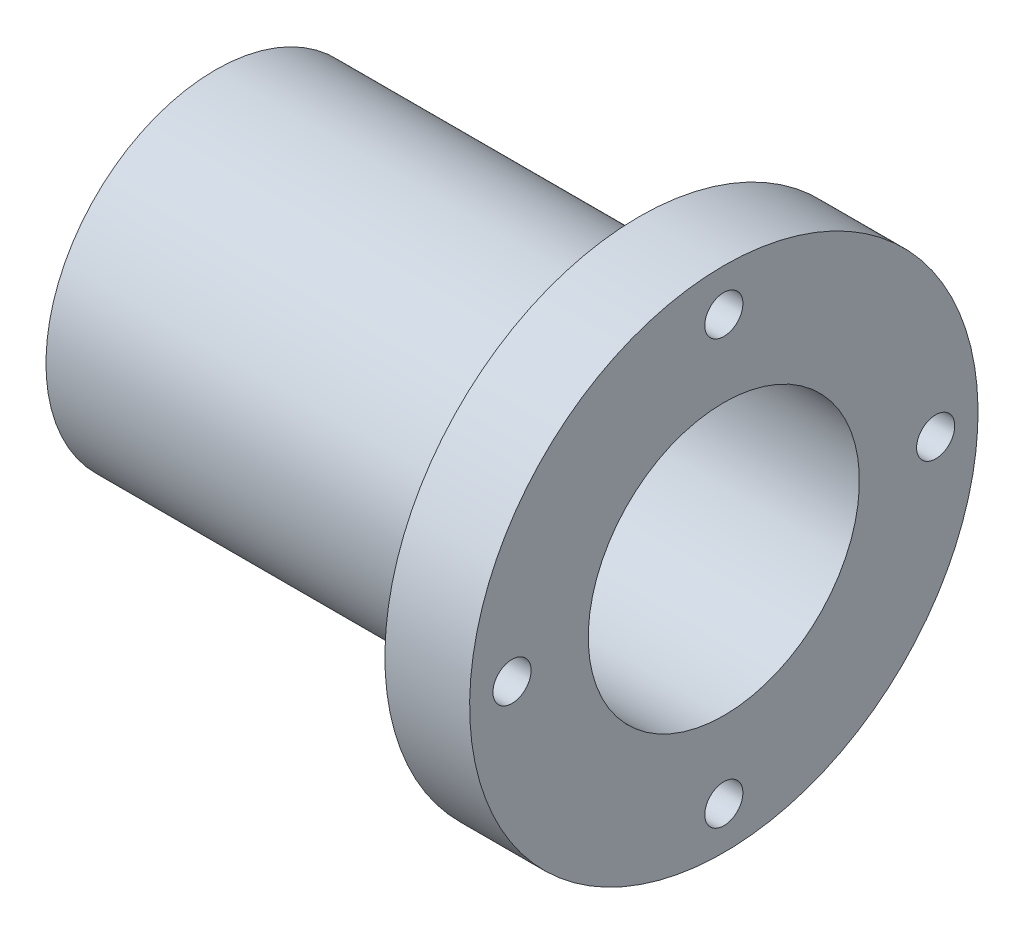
ISO-10303-21;
HEADER;
FILE_DESCRIPTION(('STEP AP214'),'2;1');
FILE_NAME('part.step','',(''),(''),'','','');
FILE_SCHEMA(('AUTOMOTIVE_DESIGN { 1 0 10303 214 1 1 1 1 }'));
ENDSEC;
DATA;
#1=APPLICATION_CONTEXT('core data for automotive mechanical design processes');
#2=APPLICATION_PROTOCOL_DEFINITION('international standard','automotive_design',2000,#1);
#3=PRODUCT_CONTEXT('',#1,'mechanical');
#4=PRODUCT('Part','Part','',(#3));
#5=PRODUCT_RELATED_PRODUCT_CATEGORY('part','',(#4));
#6=PRODUCT_DEFINITION_FORMATION('','',#4);
#7=PRODUCT_DEFINITION_CONTEXT('part definition',#1,'design');
#8=PRODUCT_DEFINITION('design','',#6,#7);
#9=PRODUCT_DEFINITION_SHAPE('','',#8);
#10=(LENGTH_UNIT() NAMED_UNIT(*) SI_UNIT(.MILLI.,.METRE.));
#11=(NAMED_UNIT(*) PLANE_ANGLE_UNIT() SI_UNIT($,.RADIAN.));
#12=(NAMED_UNIT(*) SI_UNIT($,.STERADIAN.) SOLID_ANGLE_UNIT());
#13=UNCERTAINTY_MEASURE_WITH_UNIT(LENGTH_MEASURE(1.E-05),#10,'distance_accuracy_value','');
#14=(GEOMETRIC_REPRESENTATION_CONTEXT(3) GLOBAL_UNCERTAINTY_ASSIGNED_CONTEXT((#13)) GLOBAL_UNIT_ASSIGNED_CONTEXT((#10,
#11,#12)) REPRESENTATION_CONTEXT('',''));
#15=CARTESIAN_POINT('',(0.,0.,0.));
#16=DIRECTION('',(0.,0.,1.));
#17=DIRECTION('',(1.,0.,0.));
#18=AXIS2_PLACEMENT_3D('',#15,#16,#17);
#19=CARTESIAN_POINT('',(0.,-20.,0.));
#20=DIRECTION('',(-1.,0.,0.));
#21=DIRECTION('',(0.,-1.,0.));
#22=AXIS2_PLACEMENT_3D('',#19,#20,#21);
#23=PLANE('',#22);
#24=CARTESIAN_POINT('',(0.,-20.,0.));
#25=DIRECTION('',(-1.,0.,0.));
#26=DIRECTION('',(0.,-1.,0.));
#27=AXIS2_PLACEMENT_3D('',#24,#25,#26);
#28=CIRCLE('',#27,16.);
#29=CARTESIAN_POINT('',(0.,-36.,0.));
#30=VERTEX_POINT('',#29);
#31=EDGE_CURVE('E51',#30,#30,#28,.T.);
#32=ORIENTED_EDGE('',*,*,#31,.F.);
#33=EDGE_LOOP('',(#32));
#34=FACE_BOUND('',#33,.T.);
#35=CARTESIAN_POINT('',(0.,-20.,0.));
#36=DIRECTION('',(1.,0.,0.));
#37=DIRECTION('',(0.,1.,0.));
#38=AXIS2_PLACEMENT_3D('',#35,#36,#37);
#39=CIRCLE('',#38,20.);
#40=CARTESIAN_POINT('',(0.,0.,0.));
#41=VERTEX_POINT('',#40);
#42=EDGE_CURVE('E10',#41,#41,#39,.T.);
#43=ORIENTED_EDGE('',*,*,#42,.F.);
#44=EDGE_LOOP('',(#43));
#45=FACE_BOUND('',#44,.T.);
#46=ADVANCED_FACE('F31',(#34,#45),#23,.T.);
#47=CARTESIAN_POINT('',(60.,-20.,0.));
#48=DIRECTION('',(1.,0.,0.));
#49=DIRECTION('',(0.,1.,0.));
#50=AXIS2_PLACEMENT_3D('',#47,#48,#49);
#51=CYLINDRICAL_SURFACE('',#50,20.);
#52=ORIENTED_EDGE('',*,*,#42,.T.);
#53=EDGE_LOOP('',(#52));
#54=FACE_BOUND('',#53,.T.);
#55=CARTESIAN_POINT('',(50.,-20.,0.));
#56=DIRECTION('',(1.,0.,0.));
#57=DIRECTION('',(0.,1.,0.));
#58=AXIS2_PLACEMENT_3D('',#55,#56,#57);
#59=CIRCLE('',#58,20.);
#60=CARTESIAN_POINT('',(50.,0.,0.));
#61=VERTEX_POINT('',#60);
#62=EDGE_CURVE('E37',#61,#61,#59,.T.);
#63=ORIENTED_EDGE('',*,*,#62,.F.);
#64=EDGE_LOOP('',(#63));
#65=FACE_BOUND('',#64,.T.);
#66=ADVANCED_FACE('F111',(#54,#65),#51,.T.);
#67=CARTESIAN_POINT('',(50.,0.,0.));
#68=DIRECTION('',(-1.,0.,0.));
#69=DIRECTION('',(0.,-1.,0.));
#70=AXIS2_PLACEMENT_3D('',#67,#68,#69);
#71=PLANE('',#70);
#72=CARTESIAN_POINT('',(50.,-19.9999999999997,-25.));
#73=DIRECTION('',(-1.,0.,0.));
#74=DIRECTION('',(0.,0.,1.));
#75=AXIS2_PLACEMENT_3D('',#72,#73,#74);
#76=CIRCLE('',#75,3.99999999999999);
#77=CARTESIAN_POINT('',(50.,-19.9999999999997,-21.));
#78=VERTEX_POINT('',#77);
#79=EDGE_CURVE('E101',#78,#78,#76,.T.);
#80=ORIENTED_EDGE('',*,*,#79,.F.);
#81=EDGE_LOOP('',(#80));
#82=FACE_BOUND('',#81,.T.);
#83=CARTESIAN_POINT('',(50.,-45.,0.));
#84=DIRECTION('',(-1.,0.,0.));
#85=DIRECTION('',(0.,0.,1.));
#86=AXIS2_PLACEMENT_3D('',#83,#84,#85);
#87=CIRCLE('',#86,4.);
#88=CARTESIAN_POINT('',(50.,-45.,4.));
#89=VERTEX_POINT('',#88);
#90=EDGE_CURVE('E89',#89,#89,#87,.T.);
#91=ORIENTED_EDGE('',*,*,#90,.F.);
#92=EDGE_LOOP('',(#91));
#93=FACE_BOUND('',#92,.T.);
#94=CARTESIAN_POINT('',(50.,-20.0000000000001,25.));
#95=DIRECTION('',(-1.,0.,0.));
#96=DIRECTION('',(0.,0.,1.));
#97=AXIS2_PLACEMENT_3D('',#94,#95,#96);
#98=CIRCLE('',#97,3.99999999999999);
#99=CARTESIAN_POINT('',(50.,-20.0000000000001,29.));
#100=VERTEX_POINT('',#99);
#101=EDGE_CURVE('E77',#100,#100,#98,.T.);
#102=ORIENTED_EDGE('',*,*,#101,.F.);
#103=EDGE_LOOP('',(#102));
#104=FACE_BOUND('',#103,.T.);
#105=CARTESIAN_POINT('',(50.,5.00000000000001,0.));
#106=DIRECTION('',(-1.,0.,0.));
#107=DIRECTION('',(0.,0.,1.));
#108=AXIS2_PLACEMENT_3D('',#105,#106,#107);
#109=CIRCLE('',#108,3.99999999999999);
#110=CARTESIAN_POINT('',(50.,5.00000000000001,3.99999999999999));
#111=VERTEX_POINT('',#110);
#112=EDGE_CURVE('E65',#111,#111,#109,.T.);
#113=ORIENTED_EDGE('',*,*,#112,.F.);
#114=EDGE_LOOP('',(#113));
#115=FACE_BOUND('',#114,.T.);
#116=ORIENTED_EDGE('',*,*,#62,.T.);
#117=EDGE_LOOP('',(#116));
#118=FACE_BOUND('',#117,.T.);
#119=CARTESIAN_POINT('',(50.,-20.,0.));
#120=DIRECTION('',(1.,0.,0.));
#121=DIRECTION('',(0.,1.,0.));
#122=AXIS2_PLACEMENT_3D('',#119,#120,#121);
#123=CIRCLE('',#122,30.);
#124=CARTESIAN_POINT('',(50.,10.,0.));
#125=VERTEX_POINT('',#124);
#126=EDGE_CURVE('E41',#125,#125,#123,.T.);
#127=ORIENTED_EDGE('',*,*,#126,.F.);
#128=EDGE_LOOP('',(#127));
#129=FACE_BOUND('',#128,.T.);
#130=ADVANCED_FACE('F107',(#82,#93,#104,#115,#118,#129),#71,.T.);
#131=CARTESIAN_POINT('',(60.,-20.,0.));
#132=DIRECTION('',(1.,0.,0.));
#133=DIRECTION('',(0.,1.,0.));
#134=AXIS2_PLACEMENT_3D('',#131,#132,#133);
#135=CYLINDRICAL_SURFACE('',#134,30.);
#136=ORIENTED_EDGE('',*,*,#126,.T.);
#137=EDGE_LOOP('',(#136));
#138=FACE_BOUND('',#137,.T.);
#139=CARTESIAN_POINT('',(60.,-20.,0.));
#140=DIRECTION('',(1.,0.,0.));
#141=DIRECTION('',(0.,1.,0.));
#142=AXIS2_PLACEMENT_3D('',#139,#140,#141);
#143=CIRCLE('',#142,30.);
#144=CARTESIAN_POINT('',(60.,10.,0.));
#145=VERTEX_POINT('',#144);
#146=EDGE_CURVE('E45',#145,#145,#143,.T.);
#147=ORIENTED_EDGE('',*,*,#146,.F.);
#148=EDGE_LOOP('',(#147));
#149=FACE_BOUND('',#148,.T.);
#150=ADVANCED_FACE('F110',(#138,#149),#135,.T.);
#151=CARTESIAN_POINT('',(60.,10.,0.));
#152=DIRECTION('',(1.,0.,0.));
#153=DIRECTION('',(0.,1.,0.));
#154=AXIS2_PLACEMENT_3D('',#151,#152,#153);
#155=PLANE('',#154);
#156=CARTESIAN_POINT('',(60.,-19.9999999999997,-25.));
#157=DIRECTION('',(-1.,0.,0.));
#158=DIRECTION('',(0.,0.,1.));
#159=AXIS2_PLACEMENT_3D('',#156,#157,#158);
#160=CIRCLE('',#159,2.25);
#161=CARTESIAN_POINT('',(60.,-19.9999999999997,-22.75));
#162=VERTEX_POINT('',#161);
#163=EDGE_CURVE('E92',#162,#162,#160,.T.);
#164=ORIENTED_EDGE('',*,*,#163,.T.);
#165=EDGE_LOOP('',(#164));
#166=FACE_BOUND('',#165,.T.);
#167=CARTESIAN_POINT('',(60.,-45.,0.));
#168=DIRECTION('',(-1.,0.,0.));
#169=DIRECTION('',(0.,0.,1.));
#170=AXIS2_PLACEMENT_3D('',#167,#168,#169);
#171=CIRCLE('',#170,2.25);
#172=CARTESIAN_POINT('',(60.,-45.,2.25));
#173=VERTEX_POINT('',#172);
#174=EDGE_CURVE('E80',#173,#173,#171,.T.);
#175=ORIENTED_EDGE('',*,*,#174,.T.);
#176=EDGE_LOOP('',(#175));
#177=FACE_BOUND('',#176,.T.);
#178=CARTESIAN_POINT('',(60.,-20.0000000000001,25.));
#179=DIRECTION('',(-1.,0.,0.));
#180=DIRECTION('',(0.,0.,1.));
#181=AXIS2_PLACEMENT_3D('',#178,#179,#180);
#182=CIRCLE('',#181,2.25);
#183=CARTESIAN_POINT('',(60.,-20.0000000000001,27.25));
#184=VERTEX_POINT('',#183);
#185=EDGE_CURVE('E68',#184,#184,#182,.T.);
#186=ORIENTED_EDGE('',*,*,#185,.T.);
#187=EDGE_LOOP('',(#186));
#188=FACE_BOUND('',#187,.T.);
#189=CARTESIAN_POINT('',(60.,5.00000000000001,0.));
#190=DIRECTION('',(-1.,0.,0.));
#191=DIRECTION('',(0.,0.,1.));
#192=AXIS2_PLACEMENT_3D('',#189,#190,#191);
#193=CIRCLE('',#192,2.25);
#194=CARTESIAN_POINT('',(60.,5.00000000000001,2.25));
#195=VERTEX_POINT('',#194);
#196=EDGE_CURVE('E54',#195,#195,#193,.T.);
#197=ORIENTED_EDGE('',*,*,#196,.T.);
#198=EDGE_LOOP('',(#197));
#199=FACE_BOUND('',#198,.T.);
#200=CARTESIAN_POINT('',(60.,-20.,0.));
#201=DIRECTION('',(-1.,0.,0.));
#202=DIRECTION('',(0.,-1.,0.));
#203=AXIS2_PLACEMENT_3D('',#200,#201,#202);
#204=CIRCLE('',#203,16.);
#205=CARTESIAN_POINT('',(60.,-36.,0.));
#206=VERTEX_POINT('',#205);
#207=EDGE_CURVE('E50',#206,#206,#204,.T.);
#208=ORIENTED_EDGE('',*,*,#207,.T.);
#209=EDGE_LOOP('',(#208));
#210=FACE_BOUND('',#209,.T.);
#211=ORIENTED_EDGE('',*,*,#146,.T.);
#212=EDGE_LOOP('',(#211));
#213=FACE_BOUND('',#212,.T.);
#214=ADVANCED_FACE('F123',(#166,#177,#188,#199,#210,#213),#155,.T.);
#215=CARTESIAN_POINT('',(60.,-20.,0.));
#216=DIRECTION('',(-1.,0.,0.));
#217=DIRECTION('',(0.,-1.,0.));
#218=AXIS2_PLACEMENT_3D('',#215,#216,#217);
#219=CYLINDRICAL_SURFACE('',#218,16.);
#220=ORIENTED_EDGE('',*,*,#207,.F.);
#221=EDGE_LOOP('',(#220));
#222=FACE_BOUND('',#221,.T.);
#223=ORIENTED_EDGE('',*,*,#31,.T.);
#224=EDGE_LOOP('',(#223));
#225=FACE_BOUND('',#224,.T.);
#226=ADVANCED_FACE('F128',(#222,#225),#219,.F.);
#227=CARTESIAN_POINT('',(50.,5.00000000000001,0.));
#228=DIRECTION('',(-1.,0.,0.));
#229=DIRECTION('',(0.,0.,1.));
#230=AXIS2_PLACEMENT_3D('',#227,#228,#229);
#231=CYLINDRICAL_SURFACE('',#230,2.25);
#232=ORIENTED_EDGE('',*,*,#196,.F.);
#233=EDGE_LOOP('',(#232));
#234=FACE_BOUND('',#233,.T.);
#235=CARTESIAN_POINT('',(54.,5.00000000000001,0.));
#236=DIRECTION('',(-1.,0.,0.));
#237=DIRECTION('',(0.,0.,1.));
#238=AXIS2_PLACEMENT_3D('',#235,#236,#237);
#239=CIRCLE('',#238,2.25);
#240=CARTESIAN_POINT('',(54.,5.00000000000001,2.25));
#241=VERTEX_POINT('',#240);
#242=EDGE_CURVE('E59',#241,#241,#239,.T.);
#243=ORIENTED_EDGE('',*,*,#242,.T.);
#244=EDGE_LOOP('',(#243));
#245=FACE_BOUND('',#244,.T.);
#246=ADVANCED_FACE('F134',(#234,#245),#231,.F.);
#247=CARTESIAN_POINT('',(54.,7.25000000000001,0.));
#248=DIRECTION('',(1.,0.,0.));
#249=DIRECTION('',(0.,0.,-1.));
#250=AXIS2_PLACEMENT_3D('',#247,#248,#249);
#251=PLANE('',#250);
#252=ORIENTED_EDGE('',*,*,#242,.F.);
#253=EDGE_LOOP('',(#252));
#254=FACE_BOUND('',#253,.T.);
#255=CARTESIAN_POINT('',(54.,5.00000000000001,0.));
#256=DIRECTION('',(-1.,0.,0.));
#257=DIRECTION('',(0.,0.,1.));
#258=AXIS2_PLACEMENT_3D('',#255,#256,#257);
#259=CIRCLE('',#258,4.);
#260=CARTESIAN_POINT('',(54.,5.00000000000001,4.));
#261=VERTEX_POINT('',#260);
#262=EDGE_CURVE('E62',#261,#261,#259,.T.);
#263=ORIENTED_EDGE('',*,*,#262,.T.);
#264=EDGE_LOOP('',(#263));
#265=FACE_BOUND('',#264,.T.);
#266=ADVANCED_FACE('F178',(#254,#265),#251,.F.);
#267=CARTESIAN_POINT('',(50.,5.00000000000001,0.));
#268=DIRECTION('',(-1.,0.,0.));
#269=DIRECTION('',(0.,0.,1.));
#270=AXIS2_PLACEMENT_3D('',#267,#268,#269);
#271=CYLINDRICAL_SURFACE('',#270,4.);
#272=ORIENTED_EDGE('',*,*,#262,.F.);
#273=EDGE_LOOP('',(#272));
#274=FACE_BOUND('',#273,.T.);
#275=ORIENTED_EDGE('',*,*,#112,.T.);
#276=EDGE_LOOP('',(#275));
#277=FACE_BOUND('',#276,.T.);
#278=ADVANCED_FACE('F187',(#274,#277),#271,.F.);
#279=CARTESIAN_POINT('',(50.,-20.0000000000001,25.));
#280=DIRECTION('',(-1.,0.,0.));
#281=DIRECTION('',(0.,0.,1.));
#282=AXIS2_PLACEMENT_3D('',#279,#280,#281);
#283=CYLINDRICAL_SURFACE('',#282,2.25);
#284=ORIENTED_EDGE('',*,*,#185,.F.);
#285=EDGE_LOOP('',(#284));
#286=FACE_BOUND('',#285,.T.);
#287=CARTESIAN_POINT('',(54.,-20.0000000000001,25.));
#288=DIRECTION('',(-1.,0.,0.));
#289=DIRECTION('',(0.,0.,1.));
#290=AXIS2_PLACEMENT_3D('',#287,#288,#289);
#291=CIRCLE('',#290,2.25);
#292=CARTESIAN_POINT('',(54.,-20.0000000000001,27.25));
#293=VERTEX_POINT('',#292);
#294=EDGE_CURVE('E71',#293,#293,#291,.T.);
#295=ORIENTED_EDGE('',*,*,#294,.T.);
#296=EDGE_LOOP('',(#295));
#297=FACE_BOUND('',#296,.T.);
#298=ADVANCED_FACE('F196',(#286,#297),#283,.F.);
#299=CARTESIAN_POINT('',(54.,-17.7500000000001,25.));
#300=DIRECTION('',(1.,0.,0.));
#301=DIRECTION('',(0.,0.,-1.));
#302=AXIS2_PLACEMENT_3D('',#299,#300,#301);
#303=PLANE('',#302);
#304=ORIENTED_EDGE('',*,*,#294,.F.);
#305=EDGE_LOOP('',(#304));
#306=FACE_BOUND('',#305,.T.);
#307=CARTESIAN_POINT('',(54.,-20.0000000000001,25.));
#308=DIRECTION('',(-1.,0.,0.));
#309=DIRECTION('',(0.,0.,1.));
#310=AXIS2_PLACEMENT_3D('',#307,#308,#309);
#311=CIRCLE('',#310,4.);
#312=CARTESIAN_POINT('',(54.,-20.0000000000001,29.));
#313=VERTEX_POINT('',#312);
#314=EDGE_CURVE('E74',#313,#313,#311,.T.);
#315=ORIENTED_EDGE('',*,*,#314,.T.);
#316=EDGE_LOOP('',(#315));
#317=FACE_BOUND('',#316,.T.);
#318=ADVANCED_FACE('F207',(#306,#317),#303,.F.);
#319=CARTESIAN_POINT('',(50.,-20.0000000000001,25.));
#320=DIRECTION('',(-1.,0.,0.));
#321=DIRECTION('',(0.,0.,1.));
#322=AXIS2_PLACEMENT_3D('',#319,#320,#321);
#323=CYLINDRICAL_SURFACE('',#322,3.99999999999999);
#324=ORIENTED_EDGE('',*,*,#314,.F.);
#325=EDGE_LOOP('',(#324));
#326=FACE_BOUND('',#325,.T.);
#327=ORIENTED_EDGE('',*,*,#101,.T.);
#328=EDGE_LOOP('',(#327));
#329=FACE_BOUND('',#328,.T.);
#330=ADVANCED_FACE('F214',(#326,#329),#323,.F.);
#331=CARTESIAN_POINT('',(50.,-45.,0.));
#332=DIRECTION('',(-1.,0.,0.));
#333=DIRECTION('',(0.,0.,1.));
#334=AXIS2_PLACEMENT_3D('',#331,#332,#333);
#335=CYLINDRICAL_SURFACE('',#334,2.25);
#336=ORIENTED_EDGE('',*,*,#174,.F.);
#337=EDGE_LOOP('',(#336));
#338=FACE_BOUND('',#337,.T.);
#339=CARTESIAN_POINT('',(54.,-45.,0.));
#340=DIRECTION('',(-1.,0.,0.));
#341=DIRECTION('',(0.,0.,1.));
#342=AXIS2_PLACEMENT_3D('',#339,#340,#341);
#343=CIRCLE('',#342,2.25);
#344=CARTESIAN_POINT('',(54.,-45.,2.25));
#345=VERTEX_POINT('',#344);
#346=EDGE_CURVE('E83',#345,#345,#343,.T.);
#347=ORIENTED_EDGE('',*,*,#346,.T.);
#348=EDGE_LOOP('',(#347));
#349=FACE_BOUND('',#348,.T.);
#350=ADVANCED_FACE('F222',(#338,#349),#335,.F.);
#351=CARTESIAN_POINT('',(54.,-42.75,0.));
#352=DIRECTION('',(1.,0.,0.));
#353=DIRECTION('',(0.,0.,-1.));
#354=AXIS2_PLACEMENT_3D('',#351,#352,#353);
#355=PLANE('',#354);
#356=ORIENTED_EDGE('',*,*,#346,.F.);
#357=EDGE_LOOP('',(#356));
#358=FACE_BOUND('',#357,.T.);
#359=CARTESIAN_POINT('',(54.,-45.,0.));
#360=DIRECTION('',(-1.,0.,0.));
#361=DIRECTION('',(0.,0.,1.));
#362=AXIS2_PLACEMENT_3D('',#359,#360,#361);
#363=CIRCLE('',#362,4.);
#364=CARTESIAN_POINT('',(54.,-45.,4.));
#365=VERTEX_POINT('',#364);
#366=EDGE_CURVE('E86',#365,#365,#363,.T.);
#367=ORIENTED_EDGE('',*,*,#366,.T.);
#368=EDGE_LOOP('',(#367));
#369=FACE_BOUND('',#368,.T.);
#370=ADVANCED_FACE('F230',(#358,#369),#355,.F.);
#371=CARTESIAN_POINT('',(50.,-45.,0.));
#372=DIRECTION('',(-1.,0.,0.));
#373=DIRECTION('',(0.,0.,1.));
#374=AXIS2_PLACEMENT_3D('',#371,#372,#373);
#375=CYLINDRICAL_SURFACE('',#374,4.);
#376=ORIENTED_EDGE('',*,*,#366,.F.);
#377=EDGE_LOOP('',(#376));
#378=FACE_BOUND('',#377,.T.);
#379=ORIENTED_EDGE('',*,*,#90,.T.);
#380=EDGE_LOOP('',(#379));
#381=FACE_BOUND('',#380,.T.);
#382=ADVANCED_FACE('F238',(#378,#381),#375,.F.);
#383=CARTESIAN_POINT('',(50.,-19.9999999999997,-25.));
#384=DIRECTION('',(-1.,0.,0.));
#385=DIRECTION('',(0.,0.,1.));
#386=AXIS2_PLACEMENT_3D('',#383,#384,#385);
#387=CYLINDRICAL_SURFACE('',#386,2.25);
#388=ORIENTED_EDGE('',*,*,#163,.F.);
#389=EDGE_LOOP('',(#388));
#390=FACE_BOUND('',#389,.T.);
#391=CARTESIAN_POINT('',(54.,-19.9999999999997,-25.));
#392=DIRECTION('',(-1.,0.,0.));
#393=DIRECTION('',(0.,0.,1.));
#394=AXIS2_PLACEMENT_3D('',#391,#392,#393);
#395=CIRCLE('',#394,2.25);
#396=CARTESIAN_POINT('',(54.,-19.9999999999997,-22.75));
#397=VERTEX_POINT('',#396);
#398=EDGE_CURVE('E95',#397,#397,#395,.T.);
#399=ORIENTED_EDGE('',*,*,#398,.T.);
#400=EDGE_LOOP('',(#399));
#401=FACE_BOUND('',#400,.T.);
#402=ADVANCED_FACE('F246',(#390,#401),#387,.F.);
#403=CARTESIAN_POINT('',(54.,-17.7499999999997,-25.));
#404=DIRECTION('',(1.,0.,0.));
#405=DIRECTION('',(0.,0.,-1.));
#406=AXIS2_PLACEMENT_3D('',#403,#404,#405);
#407=PLANE('',#406);
#408=ORIENTED_EDGE('',*,*,#398,.F.);
#409=EDGE_LOOP('',(#408));
#410=FACE_BOUND('',#409,.T.);
#411=CARTESIAN_POINT('',(54.,-19.9999999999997,-25.));
#412=DIRECTION('',(-1.,0.,0.));
#413=DIRECTION('',(0.,0.,1.));
#414=AXIS2_PLACEMENT_3D('',#411,#412,#413);
#415=CIRCLE('',#414,4.);
#416=CARTESIAN_POINT('',(54.,-19.9999999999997,-21.));
#417=VERTEX_POINT('',#416);
#418=EDGE_CURVE('E98',#417,#417,#415,.T.);
#419=ORIENTED_EDGE('',*,*,#418,.T.);
#420=EDGE_LOOP('',(#419));
#421=FACE_BOUND('',#420,.T.);
#422=ADVANCED_FACE('F254',(#410,#421),#407,.F.);
#423=CARTESIAN_POINT('',(50.,-19.9999999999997,-25.));
#424=DIRECTION('',(-1.,0.,0.));
#425=DIRECTION('',(0.,0.,1.));
#426=AXIS2_PLACEMENT_3D('',#423,#424,#425);
#427=CYLINDRICAL_SURFACE('',#426,3.99999999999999);
#428=ORIENTED_EDGE('',*,*,#418,.F.);
#429=EDGE_LOOP('',(#428));
#430=FACE_BOUND('',#429,.T.);
#431=ORIENTED_EDGE('',*,*,#79,.T.);
#432=EDGE_LOOP('',(#431));
#433=FACE_BOUND('',#432,.T.);
#434=ADVANCED_FACE('F105',(#430,#433),#427,.F.);
#435=CLOSED_SHELL('',(#46,#66,#130,#150,#214,#226,#246,#266,#278,#298,#318,#330,#350,#370,#382,
#402,#422,#434));
#436=MANIFOLD_SOLID_BREP('B2',#435);
#437=ADVANCED_BREP_SHAPE_REPRESENTATION('',(#18,#436),#14);
#438=SHAPE_DEFINITION_REPRESENTATION(#9,#437);
ENDSEC;
END-ISO-10303-21;
